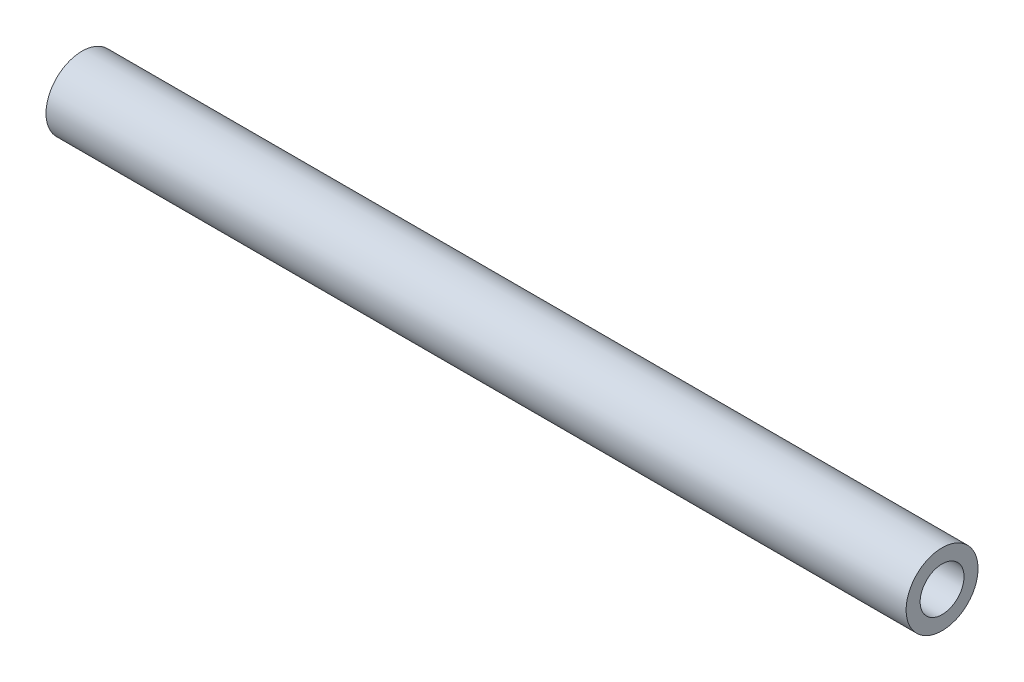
ISO-10303-21;
HEADER;
FILE_DESCRIPTION(('STEP AP214'),'2;1');
FILE_NAME('part.step','',(''),(''),'','','');
FILE_SCHEMA(('AUTOMOTIVE_DESIGN { 1 0 10303 214 1 1 1 1 }'));
ENDSEC;
DATA;
#1=APPLICATION_CONTEXT('core data for automotive mechanical design processes');
#2=APPLICATION_PROTOCOL_DEFINITION('international standard','automotive_design',2000,#1);
#3=PRODUCT_CONTEXT('',#1,'mechanical');
#4=PRODUCT('Part','Part','',(#3));
#5=PRODUCT_RELATED_PRODUCT_CATEGORY('part','',(#4));
#6=PRODUCT_DEFINITION_FORMATION('','',#4);
#7=PRODUCT_DEFINITION_CONTEXT('part definition',#1,'design');
#8=PRODUCT_DEFINITION('design','',#6,#7);
#9=PRODUCT_DEFINITION_SHAPE('','',#8);
#10=(LENGTH_UNIT() NAMED_UNIT(*) SI_UNIT(.MILLI.,.METRE.));
#11=(NAMED_UNIT(*) PLANE_ANGLE_UNIT() SI_UNIT($,.RADIAN.));
#12=(NAMED_UNIT(*) SI_UNIT($,.STERADIAN.) SOLID_ANGLE_UNIT());
#13=UNCERTAINTY_MEASURE_WITH_UNIT(LENGTH_MEASURE(1.E-05),#10,'distance_accuracy_value','');
#14=(GEOMETRIC_REPRESENTATION_CONTEXT(3) GLOBAL_UNCERTAINTY_ASSIGNED_CONTEXT((#13)) GLOBAL_UNIT_ASSIGNED_CONTEXT((#10,
#11,#12)) REPRESENTATION_CONTEXT('',''));
#15=CARTESIAN_POINT('',(0.,0.,0.));
#16=DIRECTION('',(0.,0.,1.));
#17=DIRECTION('',(1.,0.,0.));
#18=AXIS2_PLACEMENT_3D('',#15,#16,#17);
#19=CARTESIAN_POINT('',(119.5,0.,0.));
#20=DIRECTION('',(1.,0.,0.));
#21=DIRECTION('',(0.,0.,-1.));
#22=AXIS2_PLACEMENT_3D('',#19,#20,#21);
#23=PLANE('',#22);
#24=CARTESIAN_POINT('',(119.5,0.,0.));
#25=DIRECTION('',(1.,0.,0.));
#26=DIRECTION('',(0.,0.,-1.));
#27=AXIS2_PLACEMENT_3D('',#24,#25,#26);
#28=CIRCLE('',#27,5.);
#29=CARTESIAN_POINT('',(119.5,0.,5.));
#30=VERTEX_POINT('',#29);
#31=EDGE_CURVE('E10',#30,#30,#28,.T.);
#32=ORIENTED_EDGE('',*,*,#31,.T.);
#33=EDGE_LOOP('',(#32));
#34=FACE_BOUND('',#33,.T.);
#35=CARTESIAN_POINT('',(119.5,0.,0.));
#36=DIRECTION('',(1.,0.,0.));
#37=DIRECTION('',(0.,0.,-1.));
#38=AXIS2_PLACEMENT_3D('',#35,#36,#37);
#39=CIRCLE('',#38,3.05);
#40=CARTESIAN_POINT('',(119.5,0.,3.05));
#41=VERTEX_POINT('',#40);
#42=EDGE_CURVE('E41',#41,#41,#39,.T.);
#43=ORIENTED_EDGE('',*,*,#42,.F.);
#44=EDGE_LOOP('',(#43));
#45=FACE_BOUND('',#44,.T.);
#46=ADVANCED_FACE('F30',(#34,#45),#23,.T.);
#47=CARTESIAN_POINT('',(0.,0.,0.));
#48=DIRECTION('',(1.,0.,0.));
#49=DIRECTION('',(0.,0.,-1.));
#50=AXIS2_PLACEMENT_3D('',#47,#48,#49);
#51=PLANE('',#50);
#52=CARTESIAN_POINT('',(0.,0.,0.));
#53=DIRECTION('',(1.,0.,0.));
#54=DIRECTION('',(0.,0.,-1.));
#55=AXIS2_PLACEMENT_3D('',#52,#53,#54);
#56=CIRCLE('',#55,5.);
#57=CARTESIAN_POINT('',(0.,0.,5.));
#58=VERTEX_POINT('',#57);
#59=EDGE_CURVE('E34',#58,#58,#56,.T.);
#60=ORIENTED_EDGE('',*,*,#59,.F.);
#61=EDGE_LOOP('',(#60));
#62=FACE_BOUND('',#61,.T.);
#63=CARTESIAN_POINT('',(0.,0.,0.));
#64=DIRECTION('',(1.,0.,0.));
#65=DIRECTION('',(0.,0.,-1.));
#66=AXIS2_PLACEMENT_3D('',#63,#64,#65);
#67=CIRCLE('',#66,3.05);
#68=CARTESIAN_POINT('',(0.,0.,3.05));
#69=VERTEX_POINT('',#68);
#70=EDGE_CURVE('E43',#69,#69,#67,.T.);
#71=ORIENTED_EDGE('',*,*,#70,.T.);
#72=EDGE_LOOP('',(#71));
#73=FACE_BOUND('',#72,.T.);
#74=ADVANCED_FACE('F53',(#62,#73),#51,.F.);
#75=CARTESIAN_POINT('',(119.5,0.,0.));
#76=DIRECTION('',(-1.,0.,0.));
#77=DIRECTION('',(0.,0.,1.));
#78=AXIS2_PLACEMENT_3D('',#75,#76,#77);
#79=CYLINDRICAL_SURFACE('',#78,5.);
#80=CARTESIAN_POINT('',(119.5,0.,5.));
#81=CARTESIAN_POINT('',(118.255208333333,0.,5.));
#82=CARTESIAN_POINT('',(117.010416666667,0.,5.));
#83=CARTESIAN_POINT('',(114.520833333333,0.,5.));
#84=CARTESIAN_POINT('',(113.276041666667,0.,5.));
#85=CARTESIAN_POINT('',(110.786458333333,0.,5.));
#86=CARTESIAN_POINT('',(109.541666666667,0.,5.));
#87=CARTESIAN_POINT('',(107.052083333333,0.,5.));
#88=CARTESIAN_POINT('',(105.807291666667,0.,5.));
#89=CARTESIAN_POINT('',(103.317708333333,0.,5.));
#90=CARTESIAN_POINT('',(102.072916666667,0.,5.));
#91=CARTESIAN_POINT('',(99.5833333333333,0.,5.));
#92=CARTESIAN_POINT('',(98.3385416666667,0.,5.));
#93=CARTESIAN_POINT('',(95.8489583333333,0.,5.));
#94=CARTESIAN_POINT('',(94.6041666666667,0.,5.));
#95=CARTESIAN_POINT('',(92.1145833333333,0.,5.));
#96=CARTESIAN_POINT('',(90.8697916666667,0.,5.));
#97=CARTESIAN_POINT('',(88.3802083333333,0.,5.));
#98=CARTESIAN_POINT('',(87.1354166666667,0.,5.));
#99=CARTESIAN_POINT('',(84.6458333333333,0.,5.));
#100=CARTESIAN_POINT('',(83.4010416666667,0.,5.));
#101=CARTESIAN_POINT('',(80.9114583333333,0.,5.));
#102=CARTESIAN_POINT('',(79.6666666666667,0.,5.));
#103=CARTESIAN_POINT('',(77.1770833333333,0.,5.));
#104=CARTESIAN_POINT('',(75.9322916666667,0.,5.));
#105=CARTESIAN_POINT('',(73.4427083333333,0.,5.));
#106=CARTESIAN_POINT('',(72.1979166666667,0.,5.));
#107=CARTESIAN_POINT('',(69.7083333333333,0.,5.));
#108=CARTESIAN_POINT('',(68.4635416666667,0.,5.));
#109=CARTESIAN_POINT('',(65.9739583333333,0.,5.));
#110=CARTESIAN_POINT('',(64.7291666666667,0.,5.));
#111=CARTESIAN_POINT('',(62.2395833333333,0.,5.));
#112=CARTESIAN_POINT('',(60.9947916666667,0.,5.));
#113=CARTESIAN_POINT('',(58.5052083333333,0.,5.));
#114=CARTESIAN_POINT('',(57.2604166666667,0.,5.));
#115=CARTESIAN_POINT('',(54.7708333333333,0.,5.));
#116=CARTESIAN_POINT('',(53.5260416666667,0.,5.));
#117=CARTESIAN_POINT('',(51.0364583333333,0.,5.));
#118=CARTESIAN_POINT('',(49.7916666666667,0.,5.));
#119=CARTESIAN_POINT('',(47.3020833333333,0.,5.));
#120=CARTESIAN_POINT('',(46.0572916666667,0.,5.));
#121=CARTESIAN_POINT('',(43.5677083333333,0.,5.));
#122=CARTESIAN_POINT('',(42.3229166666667,0.,5.));
#123=CARTESIAN_POINT('',(39.8333333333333,0.,5.));
#124=CARTESIAN_POINT('',(38.5885416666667,0.,5.));
#125=CARTESIAN_POINT('',(36.0989583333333,0.,5.));
#126=CARTESIAN_POINT('',(34.8541666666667,0.,5.));
#127=CARTESIAN_POINT('',(32.3645833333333,0.,5.));
#128=CARTESIAN_POINT('',(31.1197916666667,0.,5.));
#129=CARTESIAN_POINT('',(28.6302083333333,0.,5.));
#130=CARTESIAN_POINT('',(27.3854166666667,0.,5.));
#131=CARTESIAN_POINT('',(24.8958333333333,0.,5.));
#132=CARTESIAN_POINT('',(23.6510416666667,0.,5.));
#133=CARTESIAN_POINT('',(21.1614583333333,0.,5.));
#134=CARTESIAN_POINT('',(19.9166666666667,0.,5.));
#135=CARTESIAN_POINT('',(17.4270833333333,0.,5.));
#136=CARTESIAN_POINT('',(16.1822916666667,0.,5.));
#137=CARTESIAN_POINT('',(13.6927083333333,0.,5.));
#138=CARTESIAN_POINT('',(12.4479166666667,0.,5.));
#139=CARTESIAN_POINT('',(9.95833333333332,0.,5.));
#140=CARTESIAN_POINT('',(8.71354166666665,0.,5.));
#141=CARTESIAN_POINT('',(6.22395833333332,0.,5.));
#142=CARTESIAN_POINT('',(4.97916666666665,0.,5.));
#143=CARTESIAN_POINT('',(2.48958333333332,0.,5.));
#144=CARTESIAN_POINT('',(1.24479166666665,0.,5.));
#145=CARTESIAN_POINT('',(0.,0.,5.));
#146=B_SPLINE_CURVE_WITH_KNOTS('',3,(#80,#81,#82,#83,#84,#85,#86,#87,#88,#89,#90,#91,#92,#93,
#94,#95,#96,#97,#98,#99,#100,#101,#102,#103,#104,#105,#106,#107,#108,#109,#110,#111,#112,#113,
#114,#115,#116,#117,#118,#119,#120,#121,#122,#123,#124,#125,#126,#127,#128,#129,#130,#131,#132,
#133,#134,#135,#136,#137,#138,#139,#140,#141,#142,#143,#144,#145),.UNSPECIFIED.,.F.,.F.,(4,2,2,
2,2,2,2,2,2,2,2,2,2,2,2,2,2,2,2,2,2,2,2,2,2,2,2,2,2,2,2,2,4),(0.,3.734375,7.46875,11.203125,
14.9375,18.671875,22.40625,26.140625,29.875,33.609375,37.34375,41.078125,44.8125,48.546875,
52.28125,56.015625,59.75,63.484375,67.21875,70.953125,74.6875,78.421875,82.15625,85.890625,
89.625,93.359375,97.09375,100.828125,104.5625,108.296875,112.03125,115.765625,119.5),.UNSPECIFIED.);
#147=EDGE_CURVE('BSEAM32',#30,#58,#146,.T.);
#148=ORIENTED_EDGE('',*,*,#31,.F.);
#149=ORIENTED_EDGE('',*,*,#59,.T.);
#150=ORIENTED_EDGE('',*,*,#147,.T.);
#151=ORIENTED_EDGE('',*,*,#147,.F.);
#152=EDGE_LOOP('',(#148,#150,#149,#151));
#153=FACE_BOUND('',#152,.T.);
#154=ADVANCED_FACE('F32',(#153),#79,.T.);
#155=CARTESIAN_POINT('',(119.5,0.,0.));
#156=DIRECTION('',(-1.,0.,0.));
#157=DIRECTION('',(0.,0.,1.));
#158=AXIS2_PLACEMENT_3D('',#155,#156,#157);
#159=CYLINDRICAL_SURFACE('',#158,3.05);
#160=CARTESIAN_POINT('',(119.5,0.,3.05));
#161=CARTESIAN_POINT('',(118.255208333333,0.,3.05));
#162=CARTESIAN_POINT('',(117.010416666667,0.,3.05));
#163=CARTESIAN_POINT('',(114.520833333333,0.,3.05));
#164=CARTESIAN_POINT('',(113.276041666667,0.,3.05));
#165=CARTESIAN_POINT('',(110.786458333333,0.,3.05));
#166=CARTESIAN_POINT('',(109.541666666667,0.,3.05));
#167=CARTESIAN_POINT('',(107.052083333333,0.,3.05));
#168=CARTESIAN_POINT('',(105.807291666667,0.,3.05));
#169=CARTESIAN_POINT('',(103.317708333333,0.,3.05));
#170=CARTESIAN_POINT('',(102.072916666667,0.,3.05));
#171=CARTESIAN_POINT('',(99.5833333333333,0.,3.05));
#172=CARTESIAN_POINT('',(98.3385416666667,0.,3.05));
#173=CARTESIAN_POINT('',(95.8489583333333,0.,3.05));
#174=CARTESIAN_POINT('',(94.6041666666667,0.,3.05));
#175=CARTESIAN_POINT('',(92.1145833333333,0.,3.05));
#176=CARTESIAN_POINT('',(90.8697916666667,0.,3.05));
#177=CARTESIAN_POINT('',(88.3802083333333,0.,3.05));
#178=CARTESIAN_POINT('',(87.1354166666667,0.,3.05));
#179=CARTESIAN_POINT('',(84.6458333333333,0.,3.05));
#180=CARTESIAN_POINT('',(83.4010416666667,0.,3.05));
#181=CARTESIAN_POINT('',(80.9114583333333,0.,3.05));
#182=CARTESIAN_POINT('',(79.6666666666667,0.,3.05));
#183=CARTESIAN_POINT('',(77.1770833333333,0.,3.05));
#184=CARTESIAN_POINT('',(75.9322916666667,0.,3.05));
#185=CARTESIAN_POINT('',(73.4427083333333,0.,3.05));
#186=CARTESIAN_POINT('',(72.1979166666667,0.,3.05));
#187=CARTESIAN_POINT('',(69.7083333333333,0.,3.05));
#188=CARTESIAN_POINT('',(68.4635416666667,0.,3.05));
#189=CARTESIAN_POINT('',(65.9739583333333,0.,3.05));
#190=CARTESIAN_POINT('',(64.7291666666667,0.,3.05));
#191=CARTESIAN_POINT('',(62.2395833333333,0.,3.05));
#192=CARTESIAN_POINT('',(60.9947916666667,0.,3.05));
#193=CARTESIAN_POINT('',(58.5052083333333,0.,3.05));
#194=CARTESIAN_POINT('',(57.2604166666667,0.,3.05));
#195=CARTESIAN_POINT('',(54.7708333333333,0.,3.05));
#196=CARTESIAN_POINT('',(53.5260416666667,0.,3.05));
#197=CARTESIAN_POINT('',(51.0364583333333,0.,3.05));
#198=CARTESIAN_POINT('',(49.7916666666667,0.,3.05));
#199=CARTESIAN_POINT('',(47.3020833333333,0.,3.05));
#200=CARTESIAN_POINT('',(46.0572916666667,0.,3.05));
#201=CARTESIAN_POINT('',(43.5677083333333,0.,3.05));
#202=CARTESIAN_POINT('',(42.3229166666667,0.,3.05));
#203=CARTESIAN_POINT('',(39.8333333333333,0.,3.05));
#204=CARTESIAN_POINT('',(38.5885416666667,0.,3.05));
#205=CARTESIAN_POINT('',(36.0989583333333,0.,3.05));
#206=CARTESIAN_POINT('',(34.8541666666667,0.,3.05));
#207=CARTESIAN_POINT('',(32.3645833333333,0.,3.05));
#208=CARTESIAN_POINT('',(31.1197916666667,0.,3.05));
#209=CARTESIAN_POINT('',(28.6302083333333,0.,3.05));
#210=CARTESIAN_POINT('',(27.3854166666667,0.,3.05));
#211=CARTESIAN_POINT('',(24.8958333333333,0.,3.05));
#212=CARTESIAN_POINT('',(23.6510416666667,0.,3.05));
#213=CARTESIAN_POINT('',(21.1614583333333,0.,3.05));
#214=CARTESIAN_POINT('',(19.9166666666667,0.,3.05));
#215=CARTESIAN_POINT('',(17.4270833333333,0.,3.05));
#216=CARTESIAN_POINT('',(16.1822916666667,0.,3.05));
#217=CARTESIAN_POINT('',(13.6927083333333,0.,3.05));
#218=CARTESIAN_POINT('',(12.4479166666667,0.,3.05));
#219=CARTESIAN_POINT('',(9.95833333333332,0.,3.05));
#220=CARTESIAN_POINT('',(8.71354166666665,0.,3.05));
#221=CARTESIAN_POINT('',(6.22395833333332,0.,3.05));
#222=CARTESIAN_POINT('',(4.97916666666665,0.,3.05));
#223=CARTESIAN_POINT('',(2.48958333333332,0.,3.05));
#224=CARTESIAN_POINT('',(1.24479166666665,0.,3.05));
#225=CARTESIAN_POINT('',(0.,0.,3.05));
#226=B_SPLINE_CURVE_WITH_KNOTS('',3,(#160,#161,#162,#163,#164,#165,#166,#167,#168,#169,#170,
#171,#172,#173,#174,#175,#176,#177,#178,#179,#180,#181,#182,#183,#184,#185,#186,#187,#188,#189,
#190,#191,#192,#193,#194,#195,#196,#197,#198,#199,#200,#201,#202,#203,#204,#205,#206,#207,#208,
#209,#210,#211,#212,#213,#214,#215,#216,#217,#218,#219,#220,#221,#222,#223,#224,#225),
.UNSPECIFIED.,.F.,.F.,(4,2,2,2,2,2,2,2,2,2,2,2,2,2,2,2,2,2,2,2,2,2,2,2,2,2,2,2,2,2,2,2,4),(0.,
3.734375,7.46875,11.203125,14.9375,18.671875,22.40625,26.140625,29.875,33.609375,37.34375,
41.078125,44.8125,48.546875,52.28125,56.015625,59.75,63.484375,67.21875,70.953125,74.6875,
78.421875,82.15625,85.890625,89.625,93.359375,97.09375,100.828125,104.5625,108.296875,112.03125,
115.765625,119.5),.UNSPECIFIED.);
#227=EDGE_CURVE('BSEAM49',#41,#69,#226,.T.);
#228=ORIENTED_EDGE('',*,*,#42,.T.);
#229=ORIENTED_EDGE('',*,*,#70,.F.);
#230=ORIENTED_EDGE('',*,*,#227,.T.);
#231=ORIENTED_EDGE('',*,*,#227,.F.);
#232=EDGE_LOOP('',(#228,#230,#229,#231));
#233=FACE_BOUND('',#232,.T.);
#234=ADVANCED_FACE('F49',(#233),#159,.F.);
#235=CLOSED_SHELL('',(#46,#74,#154,#234));
#236=MANIFOLD_SOLID_BREP('B2',#235);
#237=ADVANCED_BREP_SHAPE_REPRESENTATION('',(#18,#236),#14);
#238=SHAPE_DEFINITION_REPRESENTATION(#9,#237);
ENDSEC;
END-ISO-10303-21;
